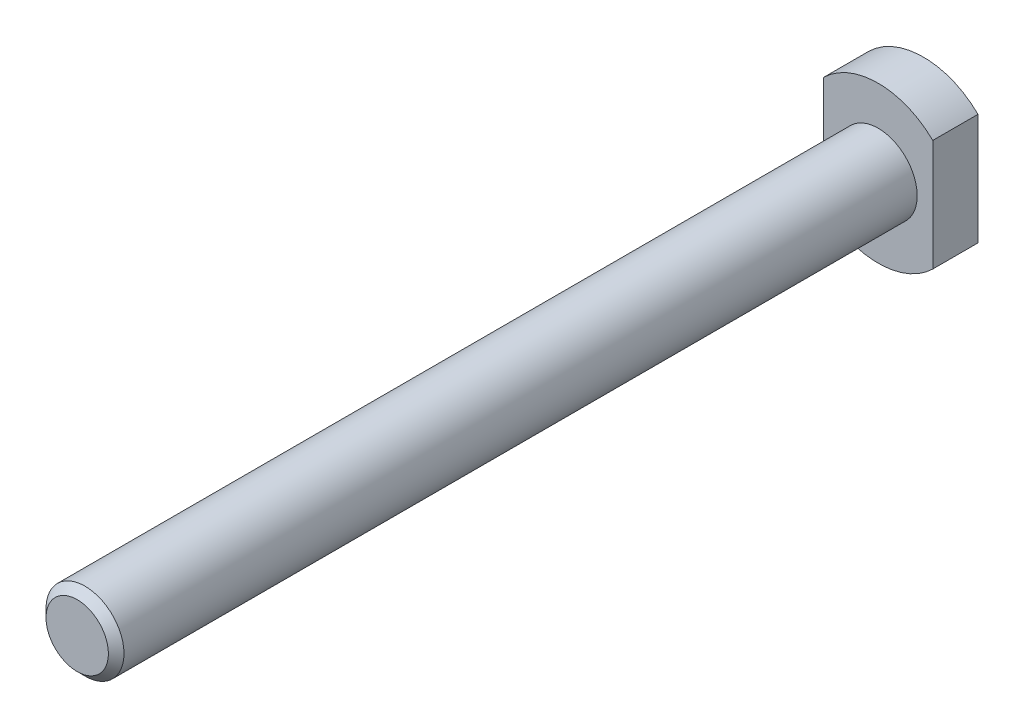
from build123d import *

# Parameters (mm, degrees)
BOSS_EXTRUDE1_DEPTH = 5.8
SKETCH2_R           = 5
BOSS_EXTRUDE2_DEPTH = 102.7
CHAMFER1_SIZE       = 1


with BuildPart() as part:
    # Sketch1 → Boss-Extrude1 (new body)
    with BuildSketch(Plane.XY):
        with BuildLine():
            Line((-7, 7.141428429), (-7, -7.141428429))
            ThreePointArc((-7, -7.141428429), (0, -10), (7, -7.141428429))
            Line((7, -7.141428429), (7, 7.141428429))
            ThreePointArc((7, 7.141428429), (0, 10), (-7, 7.141428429))
        make_face()
    extrude(amount=BOSS_EXTRUDE1_DEPTH)

    # Sketch2 → Boss-Extrude2 (add)
    with BuildSketch(Plane.XY.offset(5.8)):
        Circle(SKETCH2_R)
    extrude(amount=BOSS_EXTRUDE2_DEPTH)

    # Chamfer1
    chamfer1_edges = [part.edges().sort_by_distance(p)[0] for p in [
        (-5, 0, 108.5),
    ]]
    chamfer(chamfer1_edges, length=CHAMFER1_SIZE)


solid = part.part
